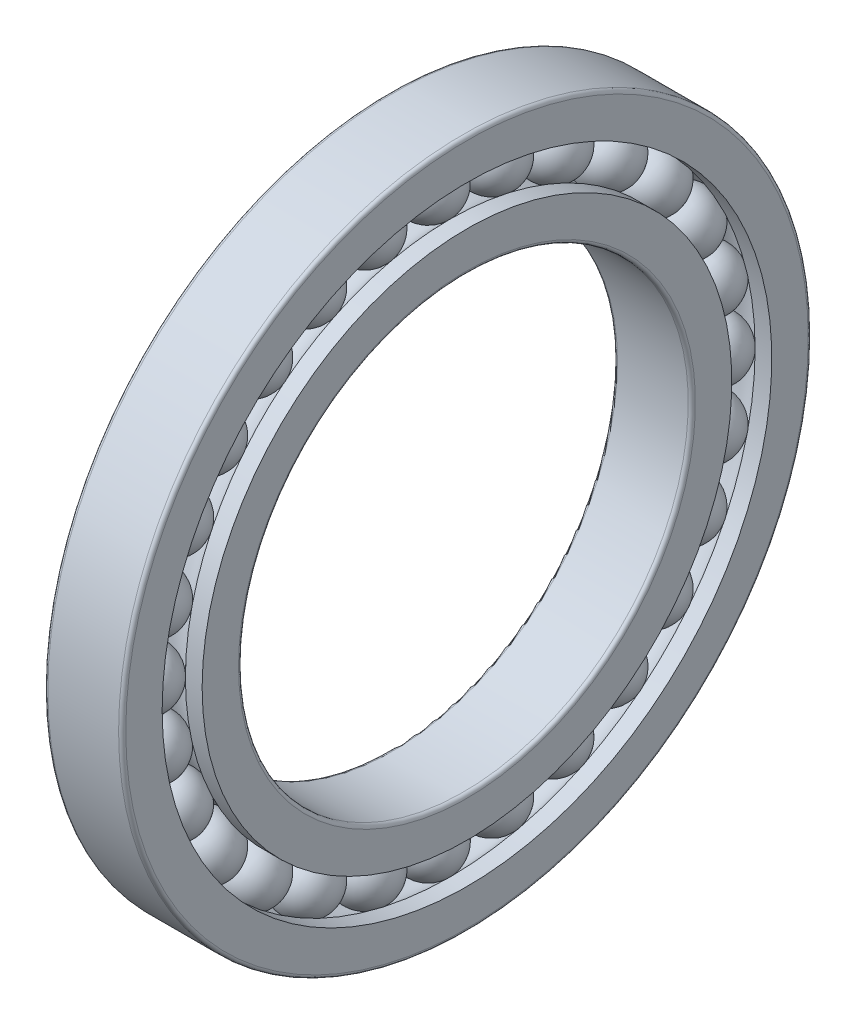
from build123d import *

# Parameters (mm, degrees)
CIRCULAR_PATTERN1_COUNT = 28
FILLET1_R               = 0.6


with BuildPart() as part:
    # Sketch1 → Revolve1 (revolve)
    with BuildSketch(Plane.XY):
        with BuildLine():
            Line((-5, 47.5), (5, 47.5))
            ThreePointArc((5, 47.5), (3.1e-16, 52.5), (-5, 47.5))
        make_face()
    revolve1 = revolve(axis=Axis((-4.596601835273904, 47.5, 0), (1, 0, 0)))

    # Sketch2 → Revolve2 (revolve)
    with BuildSketch(Plane.XY, mode=Mode.PRIVATE) as revolve2_sk:
        with BuildLine():
            Line((-6.500000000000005, 44.16666666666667), (-6.500000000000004, 37.5))
            Line((-6.500000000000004, 37.5), (6.499999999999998, 37.5))
            Line((6.499999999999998, 37.5), (6.499999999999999, 44.16666666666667))
            Line((6.499999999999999, 44.16666666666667), (3.713352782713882, 44.16666666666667))
            ThreePointArc((3.713352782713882, 44.16666666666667), (3.1e-16, 42.51), (-3.713352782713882, 44.16666666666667))
            Line((-3.713352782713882, 44.16666666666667), (-6.500000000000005, 44.16666666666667))
        make_face()
    revolve(revolve2_sk.sketch.rotate(Axis((-6.971390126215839, 0, 0), (1, 0, 0)), 90), axis=Axis((-6.971390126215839, 0, 0), (1, 0, 0)))

    # Sketch3 → Revolve3 (revolve)
    with BuildSketch(Plane.XY, mode=Mode.PRIVATE) as revolve3_sk:
        with BuildLine():
            Line((-6.500000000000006, 57.5), (6.499999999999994, 57.5))
            Line((6.499999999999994, 57.5), (6.499999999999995, 50.833333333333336))
            Line((6.499999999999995, 50.833333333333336), (3.713352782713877, 50.833333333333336))
            ThreePointArc((3.713352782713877, 50.833333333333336), (3.1e-16, 52.49), (-3.713352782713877, 50.833333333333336))
            Line((-3.713352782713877, 50.833333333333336), (-6.500000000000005, 50.833333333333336))
            Line((-6.500000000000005, 50.833333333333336), (-6.500000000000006, 57.5))
        make_face()
    revolve(revolve3_sk.sketch.rotate(Axis((-8.710676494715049, 0, 0), (1, 0, 0)), 90), axis=Axis((-8.710676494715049, 0, 0), (1, 0, 0)))

    # Circular-Pattern1: Revolve1 ×28 about axis
    circular_pattern1_axis = Axis((0, -3.6e-16, 1.6e-16), (1, 0, 0))
    for i in range(1, CIRCULAR_PATTERN1_COUNT):
        add(revolve1.rotate(circular_pattern1_axis, i * 360 / CIRCULAR_PATTERN1_COUNT))

    # Fillet1
    fillet1_edges = [part.edges().sort_by_distance(p)[0] for p in [
        (-6.500000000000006, -1.343e-14, -57.5),
        (6.499999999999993, -1.343e-14, -57.5),
        (-6.500000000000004, -8.76e-15, -37.5),
        (6.499999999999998, -8.76e-15, -37.5),
    ]]
    fillet(fillet1_edges, radius=FILLET1_R)


solid = part.part
